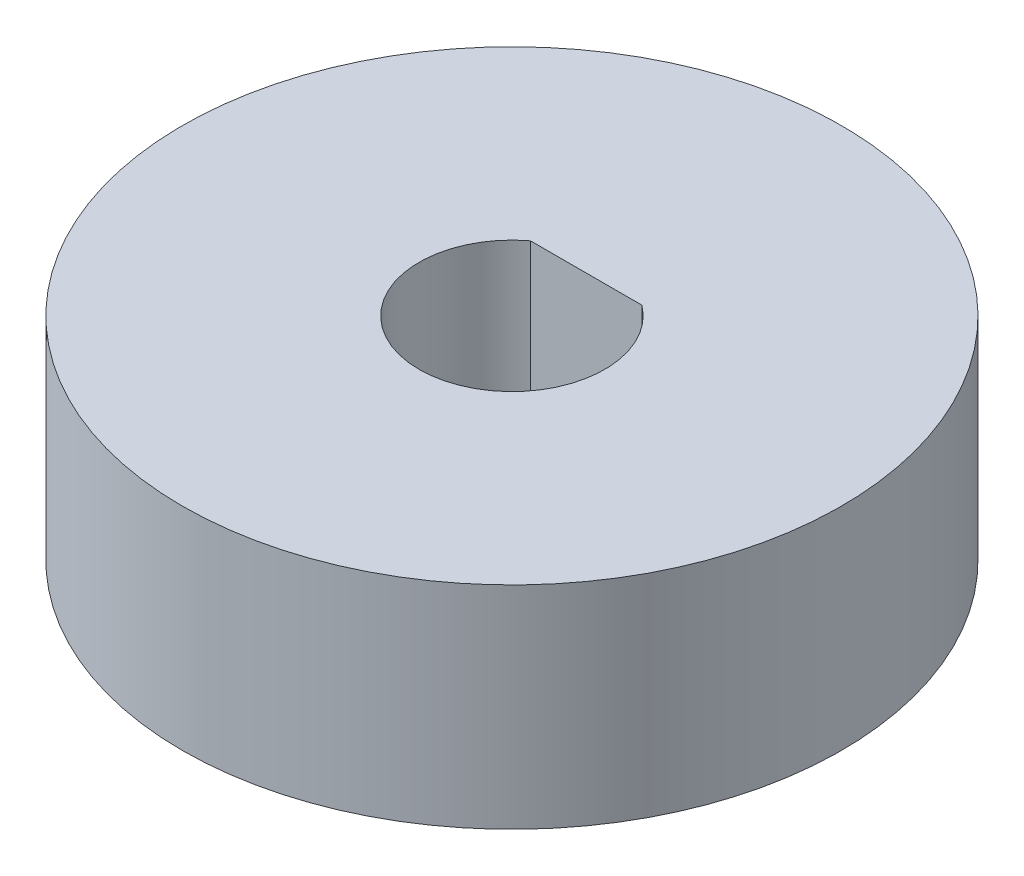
ISO-10303-21;
HEADER;
FILE_DESCRIPTION(('STEP AP214'),'2;1');
FILE_NAME('part.step','',(''),(''),'','','');
FILE_SCHEMA(('AUTOMOTIVE_DESIGN { 1 0 10303 214 1 1 1 1 }'));
ENDSEC;
DATA;
#1=APPLICATION_CONTEXT('core data for automotive mechanical design processes');
#2=APPLICATION_PROTOCOL_DEFINITION('international standard','automotive_design',2000,#1);
#3=PRODUCT_CONTEXT('',#1,'mechanical');
#4=PRODUCT('Part','Part','',(#3));
#5=PRODUCT_RELATED_PRODUCT_CATEGORY('part','',(#4));
#6=PRODUCT_DEFINITION_FORMATION('','',#4);
#7=PRODUCT_DEFINITION_CONTEXT('part definition',#1,'design');
#8=PRODUCT_DEFINITION('design','',#6,#7);
#9=PRODUCT_DEFINITION_SHAPE('','',#8);
#10=(LENGTH_UNIT() NAMED_UNIT(*) SI_UNIT(.MILLI.,.METRE.));
#11=(NAMED_UNIT(*) PLANE_ANGLE_UNIT() SI_UNIT($,.RADIAN.));
#12=(NAMED_UNIT(*) SI_UNIT($,.STERADIAN.) SOLID_ANGLE_UNIT());
#13=UNCERTAINTY_MEASURE_WITH_UNIT(LENGTH_MEASURE(1.E-05),#10,'distance_accuracy_value','');
#14=(GEOMETRIC_REPRESENTATION_CONTEXT(3) GLOBAL_UNCERTAINTY_ASSIGNED_CONTEXT((#13)) GLOBAL_UNIT_ASSIGNED_CONTEXT((#10,
#11,#12)) REPRESENTATION_CONTEXT('',''));
#15=CARTESIAN_POINT('',(0.,0.,0.));
#16=DIRECTION('',(0.,0.,1.));
#17=DIRECTION('',(1.,0.,0.));
#18=AXIS2_PLACEMENT_3D('',#15,#16,#17);
#19=CARTESIAN_POINT('',(0.,7.,0.));
#20=DIRECTION('',(0.,1.,0.));
#21=DIRECTION('',(0.,0.,1.));
#22=AXIS2_PLACEMENT_3D('',#19,#20,#21);
#23=PLANE('',#22);
#24=CARTESIAN_POINT('',(0.,7.,0.));
#25=DIRECTION('',(0.,1.,0.));
#26=DIRECTION('',(0.,0.,1.));
#27=AXIS2_PLACEMENT_3D('',#24,#25,#26);
#28=CIRCLE('',#27,10.9);
#29=CARTESIAN_POINT('',(0.,7.,10.9));
#30=VERTEX_POINT('',#29);
#31=EDGE_CURVE('E11',#30,#30,#28,.T.);
#32=ORIENTED_EDGE('',*,*,#31,.T.);
#33=EDGE_LOOP('',(#32));
#34=FACE_BOUND('',#33,.T.);
#35=DIRECTION('',(-1.,0.,0.));
#36=VECTOR('',#35,1.);
#37=CARTESIAN_POINT('',(1.84253321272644,7.,-2.4556));
#38=LINE('',#37,#36);
#39=CARTESIAN_POINT('',(1.84253321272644,7.,-2.4556));
#40=VERTEX_POINT('',#39);
#41=CARTESIAN_POINT('',(-1.84253321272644,7.,-2.4556));
#42=VERTEX_POINT('',#41);
#43=EDGE_CURVE('E72',#40,#42,#38,.T.);
#44=ORIENTED_EDGE('',*,*,#43,.F.);
#45=CARTESIAN_POINT('',(0.,7.,0.));
#46=DIRECTION('',(0.,1.,0.));
#47=DIRECTION('',(0.,0.,1.));
#48=AXIS2_PLACEMENT_3D('',#45,#46,#47);
#49=CIRCLE('',#48,3.07);
#50=EDGE_CURVE('E63',#42,#40,#49,.T.);
#51=ORIENTED_EDGE('',*,*,#50,.F.);
#52=EDGE_LOOP('',(#44,#51));
#53=FACE_BOUND('',#52,.T.);
#54=ADVANCED_FACE('F31',(#34,#53),#23,.T.);
#55=CARTESIAN_POINT('',(0.,0.,0.));
#56=DIRECTION('',(0.,1.,0.));
#57=DIRECTION('',(0.,0.,1.));
#58=AXIS2_PLACEMENT_3D('',#55,#56,#57);
#59=PLANE('',#58);
#60=CARTESIAN_POINT('',(0.,0.,0.));
#61=DIRECTION('',(0.,1.,0.));
#62=DIRECTION('',(0.,0.,1.));
#63=AXIS2_PLACEMENT_3D('',#60,#61,#62);
#64=CIRCLE('',#63,10.9);
#65=CARTESIAN_POINT('',(0.,0.,10.9));
#66=VERTEX_POINT('',#65);
#67=EDGE_CURVE('E35',#66,#66,#64,.T.);
#68=ORIENTED_EDGE('',*,*,#67,.F.);
#69=EDGE_LOOP('',(#68));
#70=FACE_BOUND('',#69,.T.);
#71=CARTESIAN_POINT('',(0.,0.,0.));
#72=DIRECTION('',(0.,1.,0.));
#73=DIRECTION('',(0.,0.,1.));
#74=AXIS2_PLACEMENT_3D('',#71,#72,#73);
#75=CIRCLE('',#74,3.07);
#76=CARTESIAN_POINT('',(-1.84253321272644,0.,-2.4556));
#77=VERTEX_POINT('',#76);
#78=CARTESIAN_POINT('',(1.84253321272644,0.,-2.4556));
#79=VERTEX_POINT('',#78);
#80=EDGE_CURVE('E53',#77,#79,#75,.T.);
#81=ORIENTED_EDGE('',*,*,#80,.T.);
#82=DIRECTION('',(-1.,0.,0.));
#83=VECTOR('',#82,1.);
#84=CARTESIAN_POINT('',(1.84253321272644,0.,-2.4556));
#85=LINE('',#84,#83);
#86=EDGE_CURVE('E59',#79,#77,#85,.T.);
#87=ORIENTED_EDGE('',*,*,#86,.T.);
#88=EDGE_LOOP('',(#81,#87));
#89=FACE_BOUND('',#88,.T.);
#90=ADVANCED_FACE('F69',(#70,#89),#59,.F.);
#91=CARTESIAN_POINT('',(0.,7.,0.));
#92=DIRECTION('',(0.,-1.,0.));
#93=DIRECTION('',(0.,0.,-1.));
#94=AXIS2_PLACEMENT_3D('',#91,#92,#93);
#95=CYLINDRICAL_SURFACE('',#94,10.9);
#96=ORIENTED_EDGE('',*,*,#31,.F.);
#97=EDGE_LOOP('',(#96));
#98=FACE_BOUND('',#97,.T.);
#99=ORIENTED_EDGE('',*,*,#67,.T.);
#100=EDGE_LOOP('',(#99));
#101=FACE_BOUND('',#100,.T.);
#102=ADVANCED_FACE('F33',(#98,#101),#95,.T.);
#103=CARTESIAN_POINT('',(0.,7.,0.));
#104=DIRECTION('',(0.,-1.,0.));
#105=DIRECTION('',(0.,0.,-1.));
#106=AXIS2_PLACEMENT_3D('',#103,#104,#105);
#107=CYLINDRICAL_SURFACE('',#106,3.07);
#108=ORIENTED_EDGE('',*,*,#80,.F.);
#109=DIRECTION('',(0.,-1.,0.));
#110=VECTOR('',#109,1.);
#111=CARTESIAN_POINT('',(-1.84253321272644,7.,-2.4556));
#112=LINE('',#111,#110);
#113=EDGE_CURVE('E61',#42,#77,#112,.T.);
#114=ORIENTED_EDGE('',*,*,#113,.F.);
#115=ORIENTED_EDGE('',*,*,#50,.T.);
#116=DIRECTION('',(0.,-1.,0.));
#117=VECTOR('',#116,1.);
#118=CARTESIAN_POINT('',(1.84253321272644,7.,-2.4556));
#119=LINE('',#118,#117);
#120=EDGE_CURVE('E46',#40,#79,#119,.T.);
#121=ORIENTED_EDGE('',*,*,#120,.T.);
#122=EDGE_LOOP('',(#108,#114,#115,#121));
#123=FACE_BOUND('',#122,.T.);
#124=ADVANCED_FACE('F65',(#123),#107,.F.);
#125=CARTESIAN_POINT('',(1.84253321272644,7.,-2.4556));
#126=DIRECTION('',(0.,0.,1.));
#127=DIRECTION('',(1.,0.,0.));
#128=AXIS2_PLACEMENT_3D('',#125,#126,#127);
#129=PLANE('',#128);
#130=ORIENTED_EDGE('',*,*,#86,.F.);
#131=ORIENTED_EDGE('',*,*,#120,.F.);
#132=ORIENTED_EDGE('',*,*,#43,.T.);
#133=ORIENTED_EDGE('',*,*,#113,.T.);
#134=EDGE_LOOP('',(#130,#131,#132,#133));
#135=FACE_BOUND('',#134,.T.);
#136=ADVANCED_FACE('F60',(#135),#129,.T.);
#137=CLOSED_SHELL('',(#54,#90,#102,#124,#136));
#138=MANIFOLD_SOLID_BREP('B2',#137);
#139=ADVANCED_BREP_SHAPE_REPRESENTATION('',(#18,#138),#14);
#140=SHAPE_DEFINITION_REPRESENTATION(#9,#139);
ENDSEC;
END-ISO-10303-21;
